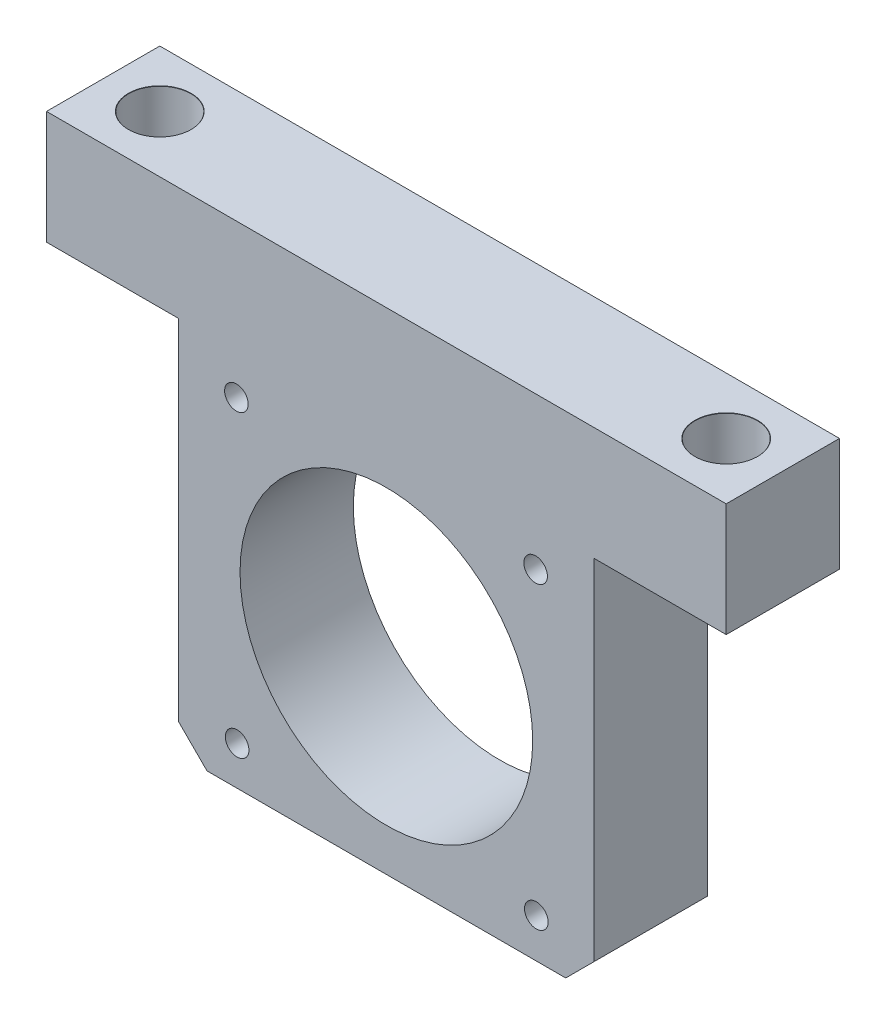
ISO-10303-21;
HEADER;
FILE_DESCRIPTION(('STEP AP214'),'2;1');
FILE_NAME('part.step','',(''),(''),'','','');
FILE_SCHEMA(('AUTOMOTIVE_DESIGN { 1 0 10303 214 1 1 1 1 }'));
ENDSEC;
DATA;
#1=APPLICATION_CONTEXT('core data for automotive mechanical design processes');
#2=APPLICATION_PROTOCOL_DEFINITION('international standard','automotive_design',2000,#1);
#3=PRODUCT_CONTEXT('',#1,'mechanical');
#4=PRODUCT('Part','Part','',(#3));
#5=PRODUCT_RELATED_PRODUCT_CATEGORY('part','',(#4));
#6=PRODUCT_DEFINITION_FORMATION('','',#4);
#7=PRODUCT_DEFINITION_CONTEXT('part definition',#1,'design');
#8=PRODUCT_DEFINITION('design','',#6,#7);
#9=PRODUCT_DEFINITION_SHAPE('','',#8);
#10=(LENGTH_UNIT() NAMED_UNIT(*) SI_UNIT(.MILLI.,.METRE.));
#11=(NAMED_UNIT(*) PLANE_ANGLE_UNIT() SI_UNIT($,.RADIAN.));
#12=(NAMED_UNIT(*) SI_UNIT($,.STERADIAN.) SOLID_ANGLE_UNIT());
#13=UNCERTAINTY_MEASURE_WITH_UNIT(LENGTH_MEASURE(1.E-05),#10,'distance_accuracy_value','');
#14=(GEOMETRIC_REPRESENTATION_CONTEXT(3) GLOBAL_UNCERTAINTY_ASSIGNED_CONTEXT((#13)) GLOBAL_UNIT_ASSIGNED_CONTEXT((#10,
#11,#12)) REPRESENTATION_CONTEXT('',''));
#15=CARTESIAN_POINT('',(0.,0.,0.));
#16=DIRECTION('',(0.,0.,1.));
#17=DIRECTION('',(1.,0.,0.));
#18=AXIS2_PLACEMENT_3D('',#15,#16,#17);
#19=CARTESIAN_POINT('',(-59.0225943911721,-10.,12.));
#20=DIRECTION('',(1.,0.,0.));
#21=DIRECTION('',(0.,0.,-1.));
#22=AXIS2_PLACEMENT_3D('',#19,#20,#21);
#23=PLANE('',#22);
#24=DIRECTION('',(0.,-1.,0.));
#25=VECTOR('',#24,1.);
#26=CARTESIAN_POINT('',(-59.0225943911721,-10.,0.));
#27=LINE('',#26,#25);
#28=CARTESIAN_POINT('',(-59.0225943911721,-10.,0.));
#29=VERTEX_POINT('',#28);
#30=CARTESIAN_POINT('',(-59.0225943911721,-22.,0.));
#31=VERTEX_POINT('',#30);
#32=EDGE_CURVE('E117',#29,#31,#27,.T.);
#33=ORIENTED_EDGE('',*,*,#32,.T.);
#34=DIRECTION('',(0.,0.,-1.));
#35=VECTOR('',#34,1.);
#36=CARTESIAN_POINT('',(-59.0225943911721,-22.,12.));
#37=LINE('',#36,#35);
#38=CARTESIAN_POINT('',(-59.0225943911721,-22.,12.));
#39=VERTEX_POINT('',#38);
#40=EDGE_CURVE('E100',#39,#31,#37,.T.);
#41=ORIENTED_EDGE('',*,*,#40,.F.);
#42=DIRECTION('',(0.,-1.,0.));
#43=VECTOR('',#42,1.);
#44=CARTESIAN_POINT('',(-59.0225943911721,-10.,12.));
#45=LINE('',#44,#43);
#46=CARTESIAN_POINT('',(-59.0225943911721,-10.,12.));
#47=VERTEX_POINT('',#46);
#48=EDGE_CURVE('E105',#47,#39,#45,.T.);
#49=ORIENTED_EDGE('',*,*,#48,.F.);
#50=DIRECTION('',(0.,0.,-1.));
#51=VECTOR('',#50,1.);
#52=CARTESIAN_POINT('',(-59.0225943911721,-10.,12.));
#53=LINE('',#52,#51);
#54=EDGE_CURVE('E165',#47,#29,#53,.T.);
#55=ORIENTED_EDGE('',*,*,#54,.T.);
#56=EDGE_LOOP('',(#33,#41,#49,#55));
#57=FACE_BOUND('',#56,.T.);
#58=ADVANCED_FACE('F16',(#57),#23,.F.);
#59=CARTESIAN_POINT('',(-59.0225943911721,-22.,12.));
#60=DIRECTION('',(0.,1.,0.));
#61=DIRECTION('',(-1.,0.,0.));
#62=AXIS2_PLACEMENT_3D('',#59,#60,#61);
#63=PLANE('',#62);
#64=CARTESIAN_POINT('',(-53.0225943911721,-22.,6.));
#65=DIRECTION('',(0.,-1.,0.));
#66=DIRECTION('',(0.,0.,-1.));
#67=AXIS2_PLACEMENT_3D('',#64,#65,#66);
#68=CIRCLE('',#67,5.525);
#69=CARTESIAN_POINT('',(-53.0225943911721,-22.,0.475));
#70=VERTEX_POINT('',#69);
#71=EDGE_CURVE('E372',#70,#70,#68,.T.);
#72=ORIENTED_EDGE('',*,*,#71,.F.);
#73=EDGE_LOOP('',(#72));
#74=FACE_BOUND('',#73,.T.);
#75=DIRECTION('',(1.,0.,0.));
#76=VECTOR('',#75,1.);
#77=CARTESIAN_POINT('',(-59.0225943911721,-22.,0.));
#78=LINE('',#77,#76);
#79=CARTESIAN_POINT('',(-45.0225943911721,-22.,0.));
#80=VERTEX_POINT('',#79);
#81=EDGE_CURVE('E152',#31,#80,#78,.T.);
#82=ORIENTED_EDGE('',*,*,#81,.T.);
#83=DIRECTION('',(0.,0.,-1.));
#84=VECTOR('',#83,1.);
#85=CARTESIAN_POINT('',(-45.0225943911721,-22.,12.));
#86=LINE('',#85,#84);
#87=CARTESIAN_POINT('',(-45.0225943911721,-22.,12.));
#88=VERTEX_POINT('',#87);
#89=EDGE_CURVE('E103',#88,#80,#86,.T.);
#90=ORIENTED_EDGE('',*,*,#89,.F.);
#91=DIRECTION('',(1.,0.,0.));
#92=VECTOR('',#91,1.);
#93=CARTESIAN_POINT('',(-59.0225943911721,-22.,12.));
#94=LINE('',#93,#92);
#95=EDGE_CURVE('E96',#39,#88,#94,.T.);
#96=ORIENTED_EDGE('',*,*,#95,.F.);
#97=ORIENTED_EDGE('',*,*,#40,.T.);
#98=EDGE_LOOP('',(#82,#90,#96,#97));
#99=FACE_BOUND('',#98,.T.);
#100=ADVANCED_FACE('F98',(#74,#99),#63,.F.);
#101=CARTESIAN_POINT('',(-45.0225943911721,-22.,12.));
#102=DIRECTION('',(1.,0.,0.));
#103=DIRECTION('',(0.,1.,0.));
#104=AXIS2_PLACEMENT_3D('',#101,#102,#103);
#105=PLANE('',#104);
#106=DIRECTION('',(0.,-1.,0.));
#107=VECTOR('',#106,1.);
#108=CARTESIAN_POINT('',(-45.0225943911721,-22.,0.));
#109=LINE('',#108,#107);
#110=CARTESIAN_POINT('',(-45.0225943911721,-59.,0.));
#111=VERTEX_POINT('',#110);
#112=EDGE_CURVE('E149',#80,#111,#109,.T.);
#113=ORIENTED_EDGE('',*,*,#112,.T.);
#114=DIRECTION('',(0.,0.,1.));
#115=VECTOR('',#114,1.);
#116=CARTESIAN_POINT('',(-45.0225943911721,-59.,12.));
#117=LINE('',#116,#115);
#118=CARTESIAN_POINT('',(-45.0225943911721,-59.,12.));
#119=VERTEX_POINT('',#118);
#120=EDGE_CURVE('E39',#111,#119,#117,.T.);
#121=ORIENTED_EDGE('',*,*,#120,.T.);
#122=DIRECTION('',(0.,-1.,0.));
#123=VECTOR('',#122,1.);
#124=CARTESIAN_POINT('',(-45.0225943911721,-22.,12.));
#125=LINE('',#124,#123);
#126=EDGE_CURVE('E104',#88,#119,#125,.T.);
#127=ORIENTED_EDGE('',*,*,#126,.F.);
#128=ORIENTED_EDGE('',*,*,#89,.T.);
#129=EDGE_LOOP('',(#113,#121,#127,#128));
#130=FACE_BOUND('',#129,.T.);
#131=ADVANCED_FACE('F151',(#130),#105,.F.);
#132=CARTESIAN_POINT('',(-45.0225943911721,-62.,12.));
#133=DIRECTION('',(0.,1.,0.));
#134=DIRECTION('',(0.,0.,1.));
#135=AXIS2_PLACEMENT_3D('',#132,#133,#134);
#136=PLANE('',#135);
#137=DIRECTION('',(1.,0.,0.));
#138=VECTOR('',#137,1.);
#139=CARTESIAN_POINT('',(-45.0225943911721,-62.,12.));
#140=LINE('',#139,#138);
#141=CARTESIAN_POINT('',(-42.0225943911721,-62.,12.));
#142=VERTEX_POINT('',#141);
#143=CARTESIAN_POINT('',(-4.02259439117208,-62.,12.));
#144=VERTEX_POINT('',#143);
#145=EDGE_CURVE('E135',#142,#144,#140,.T.);
#146=ORIENTED_EDGE('',*,*,#145,.F.);
#147=DIRECTION('',(0.,0.,-1.));
#148=VECTOR('',#147,1.);
#149=CARTESIAN_POINT('',(-42.0225943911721,-62.,12.));
#150=LINE('',#149,#148);
#151=CARTESIAN_POINT('',(-42.0225943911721,-62.,0.));
#152=VERTEX_POINT('',#151);
#153=EDGE_CURVE('E120',#142,#152,#150,.T.);
#154=ORIENTED_EDGE('',*,*,#153,.T.);
#155=DIRECTION('',(1.,0.,0.));
#156=VECTOR('',#155,1.);
#157=CARTESIAN_POINT('',(-45.0225943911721,-62.,0.));
#158=LINE('',#157,#156);
#159=CARTESIAN_POINT('',(-4.02259439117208,-62.,0.));
#160=VERTEX_POINT('',#159);
#161=EDGE_CURVE('E150',#152,#160,#158,.T.);
#162=ORIENTED_EDGE('',*,*,#161,.T.);
#163=DIRECTION('',(0.,0.,1.));
#164=VECTOR('',#163,1.);
#165=CARTESIAN_POINT('',(-4.02259439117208,-62.,12.));
#166=LINE('',#165,#164);
#167=EDGE_CURVE('E118',#160,#144,#166,.T.);
#168=ORIENTED_EDGE('',*,*,#167,.T.);
#169=EDGE_LOOP('',(#146,#154,#162,#168));
#170=FACE_BOUND('',#169,.T.);
#171=ADVANCED_FACE('F139',(#170),#136,.F.);
#172=CARTESIAN_POINT('',(-1.02259439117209,-22.,12.));
#173=DIRECTION('',(-1.,0.,0.));
#174=DIRECTION('',(0.,-1.,0.));
#175=AXIS2_PLACEMENT_3D('',#172,#173,#174);
#176=PLANE('',#175);
#177=DIRECTION('',(0.,1.,0.));
#178=VECTOR('',#177,1.);
#179=CARTESIAN_POINT('',(-1.02259439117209,-22.,12.));
#180=LINE('',#179,#178);
#181=CARTESIAN_POINT('',(-1.02259439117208,-59.,12.));
#182=VERTEX_POINT('',#181);
#183=CARTESIAN_POINT('',(-1.02259439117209,-22.,12.));
#184=VERTEX_POINT('',#183);
#185=EDGE_CURVE('E143',#182,#184,#180,.T.);
#186=ORIENTED_EDGE('',*,*,#185,.F.);
#187=DIRECTION('',(0.,0.,-1.));
#188=VECTOR('',#187,1.);
#189=CARTESIAN_POINT('',(-1.02259439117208,-59.,12.));
#190=LINE('',#189,#188);
#191=CARTESIAN_POINT('',(-1.02259439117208,-59.,0.));
#192=VERTEX_POINT('',#191);
#193=EDGE_CURVE('E11',#182,#192,#190,.T.);
#194=ORIENTED_EDGE('',*,*,#193,.T.);
#195=DIRECTION('',(0.,1.,0.));
#196=VECTOR('',#195,1.);
#197=CARTESIAN_POINT('',(-1.02259439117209,-22.,0.));
#198=LINE('',#197,#196);
#199=CARTESIAN_POINT('',(-1.02259439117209,-22.,0.));
#200=VERTEX_POINT('',#199);
#201=EDGE_CURVE('E154',#192,#200,#198,.T.);
#202=ORIENTED_EDGE('',*,*,#201,.T.);
#203=DIRECTION('',(0.,0.,-1.));
#204=VECTOR('',#203,1.);
#205=CARTESIAN_POINT('',(-1.02259439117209,-22.,12.));
#206=LINE('',#205,#204);
#207=EDGE_CURVE('E122',#184,#200,#206,.T.);
#208=ORIENTED_EDGE('',*,*,#207,.F.);
#209=EDGE_LOOP('',(#186,#194,#202,#208));
#210=FACE_BOUND('',#209,.T.);
#211=ADVANCED_FACE('F207',(#210),#176,.F.);
#212=CARTESIAN_POINT('',(-1.02259439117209,-22.,12.));
#213=DIRECTION('',(0.,1.,0.));
#214=DIRECTION('',(0.,0.,1.));
#215=AXIS2_PLACEMENT_3D('',#212,#213,#214);
#216=PLANE('',#215);
#217=CARTESIAN_POINT('',(6.97740560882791,-22.,6.));
#218=DIRECTION('',(0.,-1.,0.));
#219=DIRECTION('',(0.,0.,-1.));
#220=AXIS2_PLACEMENT_3D('',#217,#218,#219);
#221=CIRCLE('',#220,5.525);
#222=CARTESIAN_POINT('',(6.97740560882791,-22.,0.475));
#223=VERTEX_POINT('',#222);
#224=EDGE_CURVE('E351',#223,#223,#221,.T.);
#225=ORIENTED_EDGE('',*,*,#224,.F.);
#226=EDGE_LOOP('',(#225));
#227=FACE_BOUND('',#226,.T.);
#228=DIRECTION('',(1.,0.,0.));
#229=VECTOR('',#228,1.);
#230=CARTESIAN_POINT('',(-1.02259439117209,-22.,0.));
#231=LINE('',#230,#229);
#232=CARTESIAN_POINT('',(12.9774056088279,-22.,0.));
#233=VERTEX_POINT('',#232);
#234=EDGE_CURVE('E160',#200,#233,#231,.T.);
#235=ORIENTED_EDGE('',*,*,#234,.T.);
#236=DIRECTION('',(0.,0.,-1.));
#237=VECTOR('',#236,1.);
#238=CARTESIAN_POINT('',(12.9774056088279,-22.,12.));
#239=LINE('',#238,#237);
#240=CARTESIAN_POINT('',(12.9774056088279,-22.,12.));
#241=VERTEX_POINT('',#240);
#242=EDGE_CURVE('E170',#241,#233,#239,.T.);
#243=ORIENTED_EDGE('',*,*,#242,.F.);
#244=DIRECTION('',(1.,0.,0.));
#245=VECTOR('',#244,1.);
#246=CARTESIAN_POINT('',(-1.02259439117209,-22.,12.));
#247=LINE('',#246,#245);
#248=EDGE_CURVE('E179',#184,#241,#247,.T.);
#249=ORIENTED_EDGE('',*,*,#248,.F.);
#250=ORIENTED_EDGE('',*,*,#207,.T.);
#251=EDGE_LOOP('',(#235,#243,#249,#250));
#252=FACE_BOUND('',#251,.T.);
#253=ADVANCED_FACE('F177',(#227,#252),#216,.F.);
#254=CARTESIAN_POINT('',(12.9774056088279,-10.,12.));
#255=DIRECTION('',(-1.,0.,0.));
#256=DIRECTION('',(0.,-1.,0.));
#257=AXIS2_PLACEMENT_3D('',#254,#255,#256);
#258=PLANE('',#257);
#259=DIRECTION('',(0.,1.,0.));
#260=VECTOR('',#259,1.);
#261=CARTESIAN_POINT('',(12.9774056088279,-10.,0.));
#262=LINE('',#261,#260);
#263=CARTESIAN_POINT('',(12.9774056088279,-10.,0.));
#264=VERTEX_POINT('',#263);
#265=EDGE_CURVE('E162',#233,#264,#262,.T.);
#266=ORIENTED_EDGE('',*,*,#265,.T.);
#267=DIRECTION('',(0.,0.,-1.));
#268=VECTOR('',#267,1.);
#269=CARTESIAN_POINT('',(12.9774056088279,-10.,12.));
#270=LINE('',#269,#268);
#271=CARTESIAN_POINT('',(12.9774056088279,-10.,12.));
#272=VERTEX_POINT('',#271);
#273=EDGE_CURVE('E167',#272,#264,#270,.T.);
#274=ORIENTED_EDGE('',*,*,#273,.F.);
#275=DIRECTION('',(0.,1.,0.));
#276=VECTOR('',#275,1.);
#277=CARTESIAN_POINT('',(12.9774056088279,-10.,12.));
#278=LINE('',#277,#276);
#279=EDGE_CURVE('E190',#241,#272,#278,.T.);
#280=ORIENTED_EDGE('',*,*,#279,.F.);
#281=ORIENTED_EDGE('',*,*,#242,.T.);
#282=EDGE_LOOP('',(#266,#274,#280,#281));
#283=FACE_BOUND('',#282,.T.);
#284=ADVANCED_FACE('F186',(#283),#258,.F.);
#285=CARTESIAN_POINT('',(-59.0225943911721,-10.,12.));
#286=DIRECTION('',(0.,-1.,0.));
#287=DIRECTION('',(0.,0.,-1.));
#288=AXIS2_PLACEMENT_3D('',#285,#286,#287);
#289=PLANE('',#288);
#290=CARTESIAN_POINT('',(6.97740560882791,-10.,6.));
#291=DIRECTION('',(0.,-1.,0.));
#292=DIRECTION('',(0.,0.,-1.));
#293=AXIS2_PLACEMENT_3D('',#290,#291,#292);
#294=CIRCLE('',#293,3.325);
#295=CARTESIAN_POINT('',(6.97740560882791,-10.,2.675));
#296=VERTEX_POINT('',#295);
#297=EDGE_CURVE('E346',#296,#296,#294,.T.);
#298=ORIENTED_EDGE('',*,*,#297,.T.);
#299=EDGE_LOOP('',(#298));
#300=FACE_BOUND('',#299,.T.);
#301=CARTESIAN_POINT('',(-53.0225943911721,-10.,6.));
#302=DIRECTION('',(0.,-1.,0.));
#303=DIRECTION('',(0.,0.,-1.));
#304=AXIS2_PLACEMENT_3D('',#301,#302,#303);
#305=CIRCLE('',#304,3.325);
#306=CARTESIAN_POINT('',(-53.0225943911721,-10.,2.675));
#307=VERTEX_POINT('',#306);
#308=EDGE_CURVE('E369',#307,#307,#305,.T.);
#309=ORIENTED_EDGE('',*,*,#308,.T.);
#310=EDGE_LOOP('',(#309));
#311=FACE_BOUND('',#310,.T.);
#312=DIRECTION('',(-1.,0.,0.));
#313=VECTOR('',#312,1.);
#314=CARTESIAN_POINT('',(-59.0225943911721,-10.,0.));
#315=LINE('',#314,#313);
#316=EDGE_CURVE('E114',#264,#29,#315,.T.);
#317=ORIENTED_EDGE('',*,*,#316,.T.);
#318=ORIENTED_EDGE('',*,*,#54,.F.);
#319=DIRECTION('',(-1.,0.,0.));
#320=VECTOR('',#319,1.);
#321=CARTESIAN_POINT('',(-59.0225943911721,-10.,12.));
#322=LINE('',#321,#320);
#323=EDGE_CURVE('E110',#272,#47,#322,.T.);
#324=ORIENTED_EDGE('',*,*,#323,.F.);
#325=ORIENTED_EDGE('',*,*,#273,.T.);
#326=EDGE_LOOP('',(#317,#318,#324,#325));
#327=FACE_BOUND('',#326,.T.);
#328=ADVANCED_FACE('F189',(#300,#311,#327),#289,.F.);
#329=CARTESIAN_POINT('',(0.,0.,12.));
#330=DIRECTION('',(0.,0.,1.));
#331=DIRECTION('',(1.,0.,0.));
#332=AXIS2_PLACEMENT_3D('',#329,#330,#331);
#333=PLANE('',#332);
#334=CARTESIAN_POINT('',(-7.13773122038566,-57.8099025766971,12.));
#335=DIRECTION('',(0.,0.,1.));
#336=DIRECTION('',(1.,0.,0.));
#337=AXIS2_PLACEMENT_3D('',#334,#335,#336);
#338=CIRCLE('',#337,1.25);
#339=CARTESIAN_POINT('',(-5.88773122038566,-57.8099025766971,12.));
#340=VERTEX_POINT('',#339);
#341=EDGE_CURVE('E320',#340,#340,#338,.T.);
#342=ORIENTED_EDGE('',*,*,#341,.F.);
#343=EDGE_LOOP('',(#342));
#344=FACE_BOUND('',#343,.T.);
#345=CARTESIAN_POINT('',(-38.8324969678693,-57.8848631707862,12.));
#346=DIRECTION('',(0.,0.,1.));
#347=DIRECTION('',(1.,0.,0.));
#348=AXIS2_PLACEMENT_3D('',#345,#346,#347);
#349=CIRCLE('',#348,1.25);
#350=CARTESIAN_POINT('',(-37.5824969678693,-57.8848631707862,12.));
#351=VERTEX_POINT('',#350);
#352=EDGE_CURVE('E322',#351,#351,#349,.T.);
#353=ORIENTED_EDGE('',*,*,#352,.F.);
#354=EDGE_LOOP('',(#353));
#355=FACE_BOUND('',#354,.T.);
#356=CARTESIAN_POINT('',(-38.9074575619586,-26.1900974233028,12.));
#357=DIRECTION('',(0.,0.,1.));
#358=DIRECTION('',(1.,0.,0.));
#359=AXIS2_PLACEMENT_3D('',#356,#357,#358);
#360=CIRCLE('',#359,1.25);
#361=CARTESIAN_POINT('',(-37.6574575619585,-26.1900974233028,12.));
#362=VERTEX_POINT('',#361);
#363=EDGE_CURVE('E330',#362,#362,#360,.T.);
#364=ORIENTED_EDGE('',*,*,#363,.F.);
#365=EDGE_LOOP('',(#364));
#366=FACE_BOUND('',#365,.T.);
#367=CARTESIAN_POINT('',(-7.21269181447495,-26.1151368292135,12.));
#368=DIRECTION('',(0.,0.,1.));
#369=DIRECTION('',(1.,0.,0.));
#370=AXIS2_PLACEMENT_3D('',#367,#368,#369);
#371=CIRCLE('',#370,1.25);
#372=CARTESIAN_POINT('',(-5.96269181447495,-26.1151368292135,12.));
#373=VERTEX_POINT('',#372);
#374=EDGE_CURVE('E336',#373,#373,#371,.T.);
#375=ORIENTED_EDGE('',*,*,#374,.F.);
#376=EDGE_LOOP('',(#375));
#377=FACE_BOUND('',#376,.T.);
#378=CARTESIAN_POINT('',(-23.022594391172,-42.,12.));
#379=DIRECTION('',(0.,0.,-1.));
#380=DIRECTION('',(-1.,0.,0.));
#381=AXIS2_PLACEMENT_3D('',#378,#379,#380);
#382=CIRCLE('',#381,15.5);
#383=CARTESIAN_POINT('',(-38.522594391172,-42.,12.));
#384=VERTEX_POINT('',#383);
#385=EDGE_CURVE('E343',#384,#384,#382,.T.);
#386=ORIENTED_EDGE('',*,*,#385,.T.);
#387=EDGE_LOOP('',(#386));
#388=FACE_BOUND('',#387,.T.);
#389=ORIENTED_EDGE('',*,*,#126,.T.);
#390=DIRECTION('',(-0.707106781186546,0.707106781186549,0.));
#391=VECTOR('',#390,1.);
#392=CARTESIAN_POINT('',(-52.0112971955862,-52.0112971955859,12.));
#393=LINE('',#392,#391);
#394=EDGE_CURVE('E24',#119,#142,#393,.F.);
#395=ORIENTED_EDGE('',*,*,#394,.T.);
#396=ORIENTED_EDGE('',*,*,#145,.T.);
#397=DIRECTION('',(-0.707106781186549,-0.707106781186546,0.));
#398=VECTOR('',#397,1.);
#399=CARTESIAN_POINT('',(28.9887028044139,-28.9887028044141,12.));
#400=LINE('',#399,#398);
#401=EDGE_CURVE('E31',#144,#182,#400,.F.);
#402=ORIENTED_EDGE('',*,*,#401,.T.);
#403=ORIENTED_EDGE('',*,*,#185,.T.);
#404=ORIENTED_EDGE('',*,*,#248,.T.);
#405=ORIENTED_EDGE('',*,*,#279,.T.);
#406=ORIENTED_EDGE('',*,*,#323,.T.);
#407=ORIENTED_EDGE('',*,*,#48,.T.);
#408=ORIENTED_EDGE('',*,*,#95,.T.);
#409=EDGE_LOOP('',(#389,#395,#396,#402,#403,#404,#405,#406,#407,#408));
#410=FACE_BOUND('',#409,.T.);
#411=ADVANCED_FACE('F108',(#344,#355,#366,#377,#388,#410),#333,.T.);
#412=CARTESIAN_POINT('',(0.,0.,0.));
#413=DIRECTION('',(0.,0.,1.));
#414=DIRECTION('',(1.,0.,0.));
#415=AXIS2_PLACEMENT_3D('',#412,#413,#414);
#416=PLANE('',#415);
#417=CARTESIAN_POINT('',(-7.13773122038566,-57.8099025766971,0.));
#418=DIRECTION('',(0.,0.,1.));
#419=DIRECTION('',(1.,0.,0.));
#420=AXIS2_PLACEMENT_3D('',#417,#418,#419);
#421=CIRCLE('',#420,1.25);
#422=CARTESIAN_POINT('',(-5.88773122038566,-57.8099025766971,0.));
#423=VERTEX_POINT('',#422);
#424=EDGE_CURVE('E317',#423,#423,#421,.T.);
#425=ORIENTED_EDGE('',*,*,#424,.T.);
#426=EDGE_LOOP('',(#425));
#427=FACE_BOUND('',#426,.T.);
#428=CARTESIAN_POINT('',(-38.8324969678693,-57.8848631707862,0.));
#429=DIRECTION('',(0.,0.,1.));
#430=DIRECTION('',(1.,0.,0.));
#431=AXIS2_PLACEMENT_3D('',#428,#429,#430);
#432=CIRCLE('',#431,1.25);
#433=CARTESIAN_POINT('',(-37.5824969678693,-57.8848631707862,0.));
#434=VERTEX_POINT('',#433);
#435=EDGE_CURVE('E327',#434,#434,#432,.T.);
#436=ORIENTED_EDGE('',*,*,#435,.T.);
#437=EDGE_LOOP('',(#436));
#438=FACE_BOUND('',#437,.T.);
#439=CARTESIAN_POINT('',(-38.9074575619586,-26.1900974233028,0.));
#440=DIRECTION('',(0.,0.,1.));
#441=DIRECTION('',(1.,0.,0.));
#442=AXIS2_PLACEMENT_3D('',#439,#440,#441);
#443=CIRCLE('',#442,1.25);
#444=CARTESIAN_POINT('',(-37.6574575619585,-26.1900974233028,0.));
#445=VERTEX_POINT('',#444);
#446=EDGE_CURVE('E333',#445,#445,#443,.T.);
#447=ORIENTED_EDGE('',*,*,#446,.T.);
#448=EDGE_LOOP('',(#447));
#449=FACE_BOUND('',#448,.T.);
#450=CARTESIAN_POINT('',(-7.21269181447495,-26.1151368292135,0.));
#451=DIRECTION('',(0.,0.,1.));
#452=DIRECTION('',(1.,0.,0.));
#453=AXIS2_PLACEMENT_3D('',#450,#451,#452);
#454=CIRCLE('',#453,1.25);
#455=CARTESIAN_POINT('',(-5.96269181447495,-26.1151368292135,0.));
#456=VERTEX_POINT('',#455);
#457=EDGE_CURVE('E339',#456,#456,#454,.T.);
#458=ORIENTED_EDGE('',*,*,#457,.T.);
#459=EDGE_LOOP('',(#458));
#460=FACE_BOUND('',#459,.T.);
#461=CARTESIAN_POINT('',(-23.022594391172,-42.,0.));
#462=DIRECTION('',(0.,0.,-1.));
#463=DIRECTION('',(-1.,0.,0.));
#464=AXIS2_PLACEMENT_3D('',#461,#462,#463);
#465=CIRCLE('',#464,15.5);
#466=CARTESIAN_POINT('',(-38.522594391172,-42.,0.));
#467=VERTEX_POINT('',#466);
#468=EDGE_CURVE('E342',#467,#467,#465,.T.);
#469=ORIENTED_EDGE('',*,*,#468,.F.);
#470=EDGE_LOOP('',(#469));
#471=FACE_BOUND('',#470,.T.);
#472=ORIENTED_EDGE('',*,*,#161,.F.);
#473=DIRECTION('',(0.707106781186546,-0.707106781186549,0.));
#474=VECTOR('',#473,1.);
#475=CARTESIAN_POINT('',(-42.0225943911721,-62.,0.));
#476=LINE('',#475,#474);
#477=EDGE_CURVE('E130',#152,#111,#476,.F.);
#478=ORIENTED_EDGE('',*,*,#477,.T.);
#479=ORIENTED_EDGE('',*,*,#112,.F.);
#480=ORIENTED_EDGE('',*,*,#81,.F.);
#481=ORIENTED_EDGE('',*,*,#32,.F.);
#482=ORIENTED_EDGE('',*,*,#316,.F.);
#483=ORIENTED_EDGE('',*,*,#265,.F.);
#484=ORIENTED_EDGE('',*,*,#234,.F.);
#485=ORIENTED_EDGE('',*,*,#201,.F.);
#486=DIRECTION('',(0.707106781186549,0.707106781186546,0.));
#487=VECTOR('',#486,1.);
#488=CARTESIAN_POINT('',(-1.02259439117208,-59.,0.));
#489=LINE('',#488,#487);
#490=EDGE_CURVE('E128',#192,#160,#489,.F.);
#491=ORIENTED_EDGE('',*,*,#490,.T.);
#492=EDGE_LOOP('',(#472,#478,#479,#480,#481,#482,#483,#484,#485,#491));
#493=FACE_BOUND('',#492,.T.);
#494=ADVANCED_FACE('F148',(#427,#438,#449,#460,#471,#493),#416,.F.);
#495=CARTESIAN_POINT('',(-53.0225943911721,-10.025,6.));
#496=DIRECTION('',(0.,1.,0.));
#497=DIRECTION('',(0.,0.,1.));
#498=AXIS2_PLACEMENT_3D('',#495,#496,#497);
#499=CONICAL_SURFACE('',#498,3.3,0.785398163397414);
#500=ORIENTED_EDGE('',*,*,#308,.F.);
#501=EDGE_LOOP('',(#500));
#502=FACE_BOUND('',#501,.T.);
#503=CARTESIAN_POINT('',(-53.0225943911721,-10.025,6.));
#504=DIRECTION('',(0.,-1.,0.));
#505=DIRECTION('',(0.,0.,-1.));
#506=AXIS2_PLACEMENT_3D('',#503,#504,#505);
#507=CIRCLE('',#506,3.3);
#508=CARTESIAN_POINT('',(-53.0225943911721,-10.025,2.7));
#509=VERTEX_POINT('',#508);
#510=EDGE_CURVE('E194',#509,#509,#507,.T.);
#511=ORIENTED_EDGE('',*,*,#510,.T.);
#512=EDGE_LOOP('',(#511));
#513=FACE_BOUND('',#512,.T.);
#514=ADVANCED_FACE('F241',(#502,#513),#499,.F.);
#515=CARTESIAN_POINT('',(-53.0225943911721,-22.,6.));
#516=DIRECTION('',(0.,-1.,0.));
#517=DIRECTION('',(0.,0.,-1.));
#518=AXIS2_PLACEMENT_3D('',#515,#516,#517);
#519=CYLINDRICAL_SURFACE('',#518,3.3);
#520=ORIENTED_EDGE('',*,*,#510,.F.);
#521=EDGE_LOOP('',(#520));
#522=FACE_BOUND('',#521,.T.);
#523=CARTESIAN_POINT('',(-53.0225943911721,-15.175,6.));
#524=DIRECTION('',(0.,-1.,0.));
#525=DIRECTION('',(0.,0.,-1.));
#526=AXIS2_PLACEMENT_3D('',#523,#524,#525);
#527=CIRCLE('',#526,3.3);
#528=CARTESIAN_POINT('',(-53.0225943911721,-15.175,2.7));
#529=VERTEX_POINT('',#528);
#530=EDGE_CURVE('E196',#529,#529,#527,.T.);
#531=ORIENTED_EDGE('',*,*,#530,.T.);
#532=EDGE_LOOP('',(#531));
#533=FACE_BOUND('',#532,.T.);
#534=ADVANCED_FACE('F248',(#522,#533),#519,.F.);
#535=CARTESIAN_POINT('',(-53.0225943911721,-15.2,6.));
#536=DIRECTION('',(0.,-1.,0.));
#537=DIRECTION('',(0.,0.,-1.));
#538=AXIS2_PLACEMENT_3D('',#535,#536,#537);
#539=CONICAL_SURFACE('',#538,3.325,0.785398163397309);
#540=ORIENTED_EDGE('',*,*,#530,.F.);
#541=EDGE_LOOP('',(#540));
#542=FACE_BOUND('',#541,.T.);
#543=CARTESIAN_POINT('',(-53.0225943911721,-15.2,6.));
#544=DIRECTION('',(0.,-1.,0.));
#545=DIRECTION('',(0.,0.,-1.));
#546=AXIS2_PLACEMENT_3D('',#543,#544,#545);
#547=CIRCLE('',#546,3.325);
#548=CARTESIAN_POINT('',(-53.0225943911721,-15.2,2.675));
#549=VERTEX_POINT('',#548);
#550=EDGE_CURVE('E201',#549,#549,#547,.T.);
#551=ORIENTED_EDGE('',*,*,#550,.T.);
#552=EDGE_LOOP('',(#551));
#553=FACE_BOUND('',#552,.T.);
#554=ADVANCED_FACE('F252',(#542,#553),#539,.F.);
#555=CARTESIAN_POINT('',(-49.6975943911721,-15.2,6.));
#556=DIRECTION('',(0.,1.,0.));
#557=DIRECTION('',(0.,0.,1.));
#558=AXIS2_PLACEMENT_3D('',#555,#556,#557);
#559=PLANE('',#558);
#560=ORIENTED_EDGE('',*,*,#550,.F.);
#561=EDGE_LOOP('',(#560));
#562=FACE_BOUND('',#561,.T.);
#563=CARTESIAN_POINT('',(-53.0225943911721,-15.2,6.));
#564=DIRECTION('',(0.,-1.,0.));
#565=DIRECTION('',(0.,0.,-1.));
#566=AXIS2_PLACEMENT_3D('',#563,#564,#565);
#567=CIRCLE('',#566,5.5);
#568=CARTESIAN_POINT('',(-53.0225943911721,-15.2,0.5));
#569=VERTEX_POINT('',#568);
#570=EDGE_CURVE('E378',#569,#569,#567,.T.);
#571=ORIENTED_EDGE('',*,*,#570,.T.);
#572=EDGE_LOOP('',(#571));
#573=FACE_BOUND('',#572,.T.);
#574=ADVANCED_FACE('F256',(#562,#573),#559,.F.);
#575=CARTESIAN_POINT('',(-53.0225943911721,-22.,6.));
#576=DIRECTION('',(0.,-1.,0.));
#577=DIRECTION('',(0.,0.,-1.));
#578=AXIS2_PLACEMENT_3D('',#575,#576,#577);
#579=CYLINDRICAL_SURFACE('',#578,5.5);
#580=ORIENTED_EDGE('',*,*,#570,.F.);
#581=EDGE_LOOP('',(#580));
#582=FACE_BOUND('',#581,.T.);
#583=CARTESIAN_POINT('',(-53.0225943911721,-21.975,6.));
#584=DIRECTION('',(0.,-1.,0.));
#585=DIRECTION('',(0.,0.,-1.));
#586=AXIS2_PLACEMENT_3D('',#583,#584,#585);
#587=CIRCLE('',#586,5.5);
#588=CARTESIAN_POINT('',(-53.0225943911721,-21.975,0.5));
#589=VERTEX_POINT('',#588);
#590=EDGE_CURVE('E375',#589,#589,#587,.T.);
#591=ORIENTED_EDGE('',*,*,#590,.T.);
#592=EDGE_LOOP('',(#591));
#593=FACE_BOUND('',#592,.T.);
#594=ADVANCED_FACE('F260',(#582,#593),#579,.F.);
#595=CARTESIAN_POINT('',(-53.0225943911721,-22.,6.));
#596=DIRECTION('',(0.,-1.,0.));
#597=DIRECTION('',(0.,0.,-1.));
#598=AXIS2_PLACEMENT_3D('',#595,#596,#597);
#599=CONICAL_SURFACE('',#598,5.525,0.785398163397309);
#600=ORIENTED_EDGE('',*,*,#590,.F.);
#601=EDGE_LOOP('',(#600));
#602=FACE_BOUND('',#601,.T.);
#603=ORIENTED_EDGE('',*,*,#71,.T.);
#604=EDGE_LOOP('',(#603));
#605=FACE_BOUND('',#604,.T.);
#606=ADVANCED_FACE('F264',(#602,#605),#599,.F.);
#607=CARTESIAN_POINT('',(6.97740560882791,-10.025,6.));
#608=DIRECTION('',(0.,1.,0.));
#609=DIRECTION('',(0.,0.,1.));
#610=AXIS2_PLACEMENT_3D('',#607,#608,#609);
#611=CONICAL_SURFACE('',#610,3.3,0.785398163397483);
#612=ORIENTED_EDGE('',*,*,#297,.F.);
#613=EDGE_LOOP('',(#612));
#614=FACE_BOUND('',#613,.T.);
#615=CARTESIAN_POINT('',(6.97740560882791,-10.025,6.));
#616=DIRECTION('',(0.,-1.,0.));
#617=DIRECTION('',(0.,0.,-1.));
#618=AXIS2_PLACEMENT_3D('',#615,#616,#617);
#619=CIRCLE('',#618,3.3);
#620=CARTESIAN_POINT('',(6.97740560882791,-10.025,2.7));
#621=VERTEX_POINT('',#620);
#622=EDGE_CURVE('E366',#621,#621,#619,.T.);
#623=ORIENTED_EDGE('',*,*,#622,.T.);
#624=EDGE_LOOP('',(#623));
#625=FACE_BOUND('',#624,.T.);
#626=ADVANCED_FACE('F268',(#614,#625),#611,.F.);
#627=CARTESIAN_POINT('',(6.97740560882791,-22.,6.));
#628=DIRECTION('',(0.,-1.,0.));
#629=DIRECTION('',(0.,0.,-1.));
#630=AXIS2_PLACEMENT_3D('',#627,#628,#629);
#631=CYLINDRICAL_SURFACE('',#630,3.3);
#632=ORIENTED_EDGE('',*,*,#622,.F.);
#633=EDGE_LOOP('',(#632));
#634=FACE_BOUND('',#633,.T.);
#635=CARTESIAN_POINT('',(6.97740560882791,-15.175,6.));
#636=DIRECTION('',(0.,-1.,0.));
#637=DIRECTION('',(0.,0.,-1.));
#638=AXIS2_PLACEMENT_3D('',#635,#636,#637);
#639=CIRCLE('',#638,3.3);
#640=CARTESIAN_POINT('',(6.97740560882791,-15.175,2.7));
#641=VERTEX_POINT('',#640);
#642=EDGE_CURVE('E363',#641,#641,#639,.T.);
#643=ORIENTED_EDGE('',*,*,#642,.T.);
#644=EDGE_LOOP('',(#643));
#645=FACE_BOUND('',#644,.T.);
#646=ADVANCED_FACE('F272',(#634,#645),#631,.F.);
#647=CARTESIAN_POINT('',(6.97740560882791,-15.2,6.));
#648=DIRECTION('',(0.,-1.,0.));
#649=DIRECTION('',(0.,0.,-1.));
#650=AXIS2_PLACEMENT_3D('',#647,#648,#649);
#651=CONICAL_SURFACE('',#650,3.325,0.785398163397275);
#652=ORIENTED_EDGE('',*,*,#642,.F.);
#653=EDGE_LOOP('',(#652));
#654=FACE_BOUND('',#653,.T.);
#655=CARTESIAN_POINT('',(6.97740560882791,-15.2,6.));
#656=DIRECTION('',(0.,-1.,0.));
#657=DIRECTION('',(0.,0.,-1.));
#658=AXIS2_PLACEMENT_3D('',#655,#656,#657);
#659=CIRCLE('',#658,3.325);
#660=CARTESIAN_POINT('',(6.97740560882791,-15.2,2.675));
#661=VERTEX_POINT('',#660);
#662=EDGE_CURVE('E360',#661,#661,#659,.T.);
#663=ORIENTED_EDGE('',*,*,#662,.T.);
#664=EDGE_LOOP('',(#663));
#665=FACE_BOUND('',#664,.T.);
#666=ADVANCED_FACE('F276',(#654,#665),#651,.F.);
#667=CARTESIAN_POINT('',(10.3024056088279,-15.2,6.));
#668=DIRECTION('',(0.,1.,0.));
#669=DIRECTION('',(0.,0.,1.));
#670=AXIS2_PLACEMENT_3D('',#667,#668,#669);
#671=PLANE('',#670);
#672=ORIENTED_EDGE('',*,*,#662,.F.);
#673=EDGE_LOOP('',(#672));
#674=FACE_BOUND('',#673,.T.);
#675=CARTESIAN_POINT('',(6.97740560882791,-15.2,6.));
#676=DIRECTION('',(0.,-1.,0.));
#677=DIRECTION('',(0.,0.,-1.));
#678=AXIS2_PLACEMENT_3D('',#675,#676,#677);
#679=CIRCLE('',#678,5.5);
#680=CARTESIAN_POINT('',(6.97740560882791,-15.2,0.5));
#681=VERTEX_POINT('',#680);
#682=EDGE_CURVE('E357',#681,#681,#679,.T.);
#683=ORIENTED_EDGE('',*,*,#682,.T.);
#684=EDGE_LOOP('',(#683));
#685=FACE_BOUND('',#684,.T.);
#686=ADVANCED_FACE('F280',(#674,#685),#671,.F.);
#687=CARTESIAN_POINT('',(6.97740560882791,-22.,6.));
#688=DIRECTION('',(0.,-1.,0.));
#689=DIRECTION('',(0.,0.,-1.));
#690=AXIS2_PLACEMENT_3D('',#687,#688,#689);
#691=CYLINDRICAL_SURFACE('',#690,5.5);
#692=ORIENTED_EDGE('',*,*,#682,.F.);
#693=EDGE_LOOP('',(#692));
#694=FACE_BOUND('',#693,.T.);
#695=CARTESIAN_POINT('',(6.97740560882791,-21.975,6.));
#696=DIRECTION('',(0.,-1.,0.));
#697=DIRECTION('',(0.,0.,-1.));
#698=AXIS2_PLACEMENT_3D('',#695,#696,#697);
#699=CIRCLE('',#698,5.5);
#700=CARTESIAN_POINT('',(6.97740560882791,-21.975,0.5));
#701=VERTEX_POINT('',#700);
#702=EDGE_CURVE('E354',#701,#701,#699,.T.);
#703=ORIENTED_EDGE('',*,*,#702,.T.);
#704=EDGE_LOOP('',(#703));
#705=FACE_BOUND('',#704,.T.);
#706=ADVANCED_FACE('F284',(#694,#705),#691,.F.);
#707=CARTESIAN_POINT('',(6.97740560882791,-22.,6.));
#708=DIRECTION('',(0.,-1.,0.));
#709=DIRECTION('',(0.,0.,-1.));
#710=AXIS2_PLACEMENT_3D('',#707,#708,#709);
#711=CONICAL_SURFACE('',#710,5.525,0.785398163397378);
#712=ORIENTED_EDGE('',*,*,#702,.F.);
#713=EDGE_LOOP('',(#712));
#714=FACE_BOUND('',#713,.T.);
#715=ORIENTED_EDGE('',*,*,#224,.T.);
#716=EDGE_LOOP('',(#715));
#717=FACE_BOUND('',#716,.T.);
#718=ADVANCED_FACE('F288',(#714,#717),#711,.F.);
#719=CARTESIAN_POINT('',(-23.022594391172,-42.,12.));
#720=DIRECTION('',(0.,0.,-1.));
#721=DIRECTION('',(-1.,0.,0.));
#722=AXIS2_PLACEMENT_3D('',#719,#720,#721);
#723=CYLINDRICAL_SURFACE('',#722,15.5);
#724=ORIENTED_EDGE('',*,*,#385,.F.);
#725=EDGE_LOOP('',(#724));
#726=FACE_BOUND('',#725,.T.);
#727=ORIENTED_EDGE('',*,*,#468,.T.);
#728=EDGE_LOOP('',(#727));
#729=FACE_BOUND('',#728,.T.);
#730=ADVANCED_FACE('F292',(#726,#729),#723,.F.);
#731=CARTESIAN_POINT('',(-7.21269181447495,-26.1151368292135,12.));
#732=DIRECTION('',(0.,0.,1.));
#733=DIRECTION('',(1.,0.,0.));
#734=AXIS2_PLACEMENT_3D('',#731,#732,#733);
#735=CYLINDRICAL_SURFACE('',#734,1.25);
#736=ORIENTED_EDGE('',*,*,#457,.F.);
#737=EDGE_LOOP('',(#736));
#738=FACE_BOUND('',#737,.T.);
#739=ORIENTED_EDGE('',*,*,#374,.T.);
#740=EDGE_LOOP('',(#739));
#741=FACE_BOUND('',#740,.T.);
#742=ADVANCED_FACE('F296',(#738,#741),#735,.F.);
#743=CARTESIAN_POINT('',(-38.9074575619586,-26.1900974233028,12.));
#744=DIRECTION('',(0.,0.,1.));
#745=DIRECTION('',(1.,0.,0.));
#746=AXIS2_PLACEMENT_3D('',#743,#744,#745);
#747=CYLINDRICAL_SURFACE('',#746,1.25);
#748=ORIENTED_EDGE('',*,*,#446,.F.);
#749=EDGE_LOOP('',(#748));
#750=FACE_BOUND('',#749,.T.);
#751=ORIENTED_EDGE('',*,*,#363,.T.);
#752=EDGE_LOOP('',(#751));
#753=FACE_BOUND('',#752,.T.);
#754=ADVANCED_FACE('F300',(#750,#753),#747,.F.);
#755=CARTESIAN_POINT('',(-38.8324969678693,-57.8848631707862,12.));
#756=DIRECTION('',(0.,0.,1.));
#757=DIRECTION('',(1.,0.,0.));
#758=AXIS2_PLACEMENT_3D('',#755,#756,#757);
#759=CYLINDRICAL_SURFACE('',#758,1.25);
#760=ORIENTED_EDGE('',*,*,#435,.F.);
#761=EDGE_LOOP('',(#760));
#762=FACE_BOUND('',#761,.T.);
#763=ORIENTED_EDGE('',*,*,#352,.T.);
#764=EDGE_LOOP('',(#763));
#765=FACE_BOUND('',#764,.T.);
#766=ADVANCED_FACE('F304',(#762,#765),#759,.F.);
#767=CARTESIAN_POINT('',(-7.13773122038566,-57.8099025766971,12.));
#768=DIRECTION('',(0.,0.,1.));
#769=DIRECTION('',(1.,0.,0.));
#770=AXIS2_PLACEMENT_3D('',#767,#768,#769);
#771=CYLINDRICAL_SURFACE('',#770,1.25);
#772=ORIENTED_EDGE('',*,*,#424,.F.);
#773=EDGE_LOOP('',(#772));
#774=FACE_BOUND('',#773,.T.);
#775=ORIENTED_EDGE('',*,*,#341,.T.);
#776=EDGE_LOOP('',(#775));
#777=FACE_BOUND('',#776,.T.);
#778=ADVANCED_FACE('F215',(#774,#777),#771,.F.);
#779=CARTESIAN_POINT('',(-42.0225943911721,-62.,12.));
#780=DIRECTION('',(0.707106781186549,0.707106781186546,0.));
#781=DIRECTION('',(0.,0.,-1.));
#782=AXIS2_PLACEMENT_3D('',#779,#780,#781);
#783=PLANE('',#782);
#784=ORIENTED_EDGE('',*,*,#394,.F.);
#785=ORIENTED_EDGE('',*,*,#120,.F.);
#786=ORIENTED_EDGE('',*,*,#477,.F.);
#787=ORIENTED_EDGE('',*,*,#153,.F.);
#788=EDGE_LOOP('',(#784,#785,#786,#787));
#789=FACE_BOUND('',#788,.T.);
#790=ADVANCED_FACE('F145',(#789),#783,.F.);
#791=CARTESIAN_POINT('',(-1.02259439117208,-59.,12.));
#792=DIRECTION('',(-0.707106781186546,0.707106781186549,0.));
#793=DIRECTION('',(0.,0.,-1.));
#794=AXIS2_PLACEMENT_3D('',#791,#792,#793);
#795=PLANE('',#794);
#796=ORIENTED_EDGE('',*,*,#401,.F.);
#797=ORIENTED_EDGE('',*,*,#167,.F.);
#798=ORIENTED_EDGE('',*,*,#490,.F.);
#799=ORIENTED_EDGE('',*,*,#193,.F.);
#800=EDGE_LOOP('',(#796,#797,#798,#799));
#801=FACE_BOUND('',#800,.T.);
#802=ADVANCED_FACE('F18',(#801),#795,.F.);
#803=CLOSED_SHELL('',(#58,#100,#131,#171,#211,#253,#284,#328,#411,#494,#514,#534,#554,#574,#594,
#606,#626,#646,#666,#686,#706,#718,#730,#742,#754,#766,#778,#790,#802));
#804=MANIFOLD_SOLID_BREP('B1',#803);
#805=ADVANCED_BREP_SHAPE_REPRESENTATION('',(#18,#804),#14);
#806=SHAPE_DEFINITION_REPRESENTATION(#9,#805);
ENDSEC;
END-ISO-10303-21;
